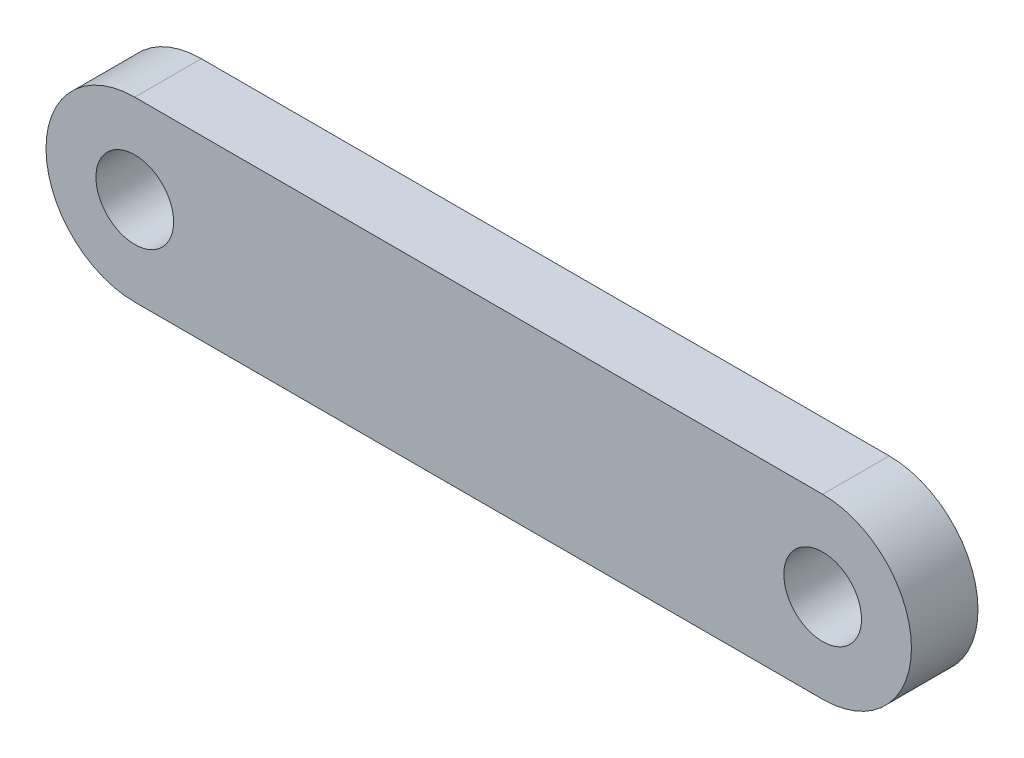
from build123d import *

# Parameters (mm, degrees)
SKETCH_1_R      = 1.75
EXTRUDE_1_DEPTH = 3


with BuildPart() as part:
    # Sketch 1 → Extrude 1 (new body)
    with BuildSketch(Plane.XY):
        with BuildLine():
            Line((0, 4), (31, 4))
            ThreePointArc((31, 4), (35, 0), (31, -4))
            Line((31, -4), (0, -4))
            ThreePointArc((0, -4), (-4, 0), (0, 4))
        make_face()
        Circle(SKETCH_1_R, mode=Mode.SUBTRACT)
        with Locations((31, 0)):
            Circle(SKETCH_1_R, mode=Mode.SUBTRACT)
    extrude(amount=EXTRUDE_1_DEPTH)


solid = part.part
